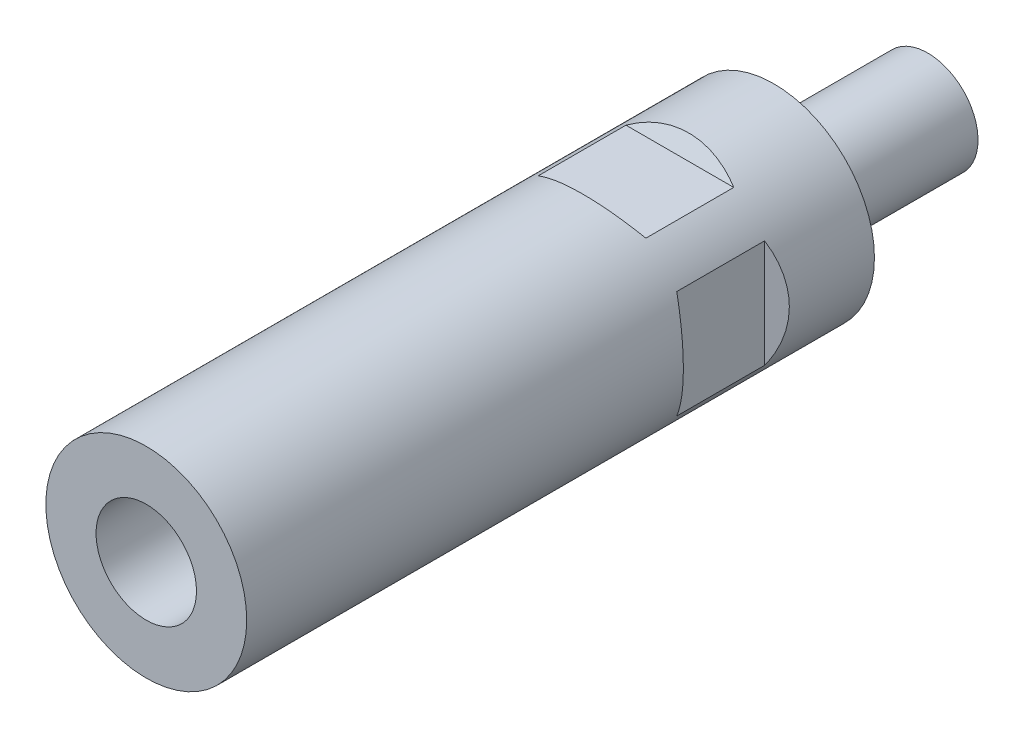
ISO-10303-21;
HEADER;
FILE_DESCRIPTION(('STEP AP214'),'2;1');
FILE_NAME('part.step','',(''),(''),'','','');
FILE_SCHEMA(('AUTOMOTIVE_DESIGN { 1 0 10303 214 1 1 1 1 }'));
ENDSEC;
DATA;
#1=APPLICATION_CONTEXT('core data for automotive mechanical design processes');
#2=APPLICATION_PROTOCOL_DEFINITION('international standard','automotive_design',2000,#1);
#3=PRODUCT_CONTEXT('',#1,'mechanical');
#4=PRODUCT('Part','Part','',(#3));
#5=PRODUCT_RELATED_PRODUCT_CATEGORY('part','',(#4));
#6=PRODUCT_DEFINITION_FORMATION('','',#4);
#7=PRODUCT_DEFINITION_CONTEXT('part definition',#1,'design');
#8=PRODUCT_DEFINITION('design','',#6,#7);
#9=PRODUCT_DEFINITION_SHAPE('','',#8);
#10=(LENGTH_UNIT() NAMED_UNIT(*) SI_UNIT(.MILLI.,.METRE.));
#11=(NAMED_UNIT(*) PLANE_ANGLE_UNIT() SI_UNIT($,.RADIAN.));
#12=(NAMED_UNIT(*) SI_UNIT($,.STERADIAN.) SOLID_ANGLE_UNIT());
#13=UNCERTAINTY_MEASURE_WITH_UNIT(LENGTH_MEASURE(1.E-05),#10,'distance_accuracy_value','');
#14=(GEOMETRIC_REPRESENTATION_CONTEXT(3) GLOBAL_UNCERTAINTY_ASSIGNED_CONTEXT((#13)) GLOBAL_UNIT_ASSIGNED_CONTEXT((#10,
#11,#12)) REPRESENTATION_CONTEXT('',''));
#15=CARTESIAN_POINT('',(0.,0.,0.));
#16=DIRECTION('',(0.,0.,1.));
#17=DIRECTION('',(1.,0.,0.));
#18=AXIS2_PLACEMENT_3D('',#15,#16,#17);
#19=CARTESIAN_POINT('',(0.,0.,-4.5));
#20=DIRECTION('',(0.,0.,1.));
#21=DIRECTION('',(0.,-1.,0.));
#22=AXIS2_PLACEMENT_3D('',#19,#20,#21);
#23=CYLINDRICAL_SURFACE('',#22,8.);
#24=CARTESIAN_POINT('',(0.,0.,-24.5));
#25=DIRECTION('',(0.,0.,1.));
#26=DIRECTION('',(0.,-1.,0.));
#27=AXIS2_PLACEMENT_3D('',#24,#25,#26);
#28=CIRCLE('',#27,8.);
#29=CARTESIAN_POINT('',(0.,-8.,-24.5));
#30=VERTEX_POINT('',#29);
#31=EDGE_CURVE('E22',#30,#30,#28,.F.);
#32=ORIENTED_EDGE('',*,*,#31,.F.);
#33=EDGE_LOOP('',(#32));
#34=FACE_BOUND('',#33,.T.);
#35=CARTESIAN_POINT('',(0.,0.,0.));
#36=DIRECTION('',(0.,0.,1.));
#37=DIRECTION('',(1.,0.,0.));
#38=AXIS2_PLACEMENT_3D('',#35,#36,#37);
#39=CIRCLE('',#38,8.);
#40=CARTESIAN_POINT('',(8.,0.,0.));
#41=VERTEX_POINT('',#40);
#42=EDGE_CURVE('E9',#41,#41,#39,.T.);
#43=ORIENTED_EDGE('',*,*,#42,.F.);
#44=EDGE_LOOP('',(#43));
#45=FACE_BOUND('',#44,.T.);
#46=ADVANCED_FACE('F14',(#34,#45),#23,.T.);
#47=CARTESIAN_POINT('',(0.,0.,-24.5));
#48=DIRECTION('',(0.,0.,1.));
#49=DIRECTION('',(0.,-1.,0.));
#50=AXIS2_PLACEMENT_3D('',#47,#48,#49);
#51=PLANE('',#50);
#52=ORIENTED_EDGE('',*,*,#31,.T.);
#53=EDGE_LOOP('',(#52));
#54=FACE_BOUND('',#53,.T.);
#55=ADVANCED_FACE('F16',(#54),#51,.F.);
#56=CARTESIAN_POINT('',(7.,0.,60.));
#57=DIRECTION('',(0.,0.,-1.));
#58=DIRECTION('',(-1.,0.,0.));
#59=AXIS2_PLACEMENT_3D('',#56,#57,#58);
#60=PLANE('',#59);
#61=CARTESIAN_POINT('',(0.,0.,60.));
#62=DIRECTION('',(0.,0.,1.));
#63=DIRECTION('',(1.,0.,0.));
#64=AXIS2_PLACEMENT_3D('',#61,#62,#63);
#65=CIRCLE('',#64,8.);
#66=CARTESIAN_POINT('',(8.,0.,60.));
#67=VERTEX_POINT('',#66);
#68=EDGE_CURVE('E251',#67,#67,#65,.T.);
#69=ORIENTED_EDGE('',*,*,#68,.T.);
#70=EDGE_LOOP('',(#69));
#71=FACE_BOUND('',#70,.T.);
#72=ADVANCED_FACE('F125',(#71),#60,.F.);
#73=CARTESIAN_POINT('',(0.,0.,100.));
#74=DIRECTION('',(0.,0.,1.));
#75=DIRECTION('',(1.,0.,0.));
#76=AXIS2_PLACEMENT_3D('',#73,#74,#75);
#77=CYLINDRICAL_SURFACE('',#76,8.);
#78=ORIENTED_EDGE('',*,*,#68,.F.);
#79=EDGE_LOOP('',(#78));
#80=FACE_BOUND('',#79,.T.);
#81=CARTESIAN_POINT('',(0.,0.,100.));
#82=DIRECTION('',(0.,0.,1.));
#83=DIRECTION('',(1.,0.,0.));
#84=AXIS2_PLACEMENT_3D('',#81,#82,#83);
#85=CIRCLE('',#84,8.);
#86=CARTESIAN_POINT('',(8.,0.,100.));
#87=VERTEX_POINT('',#86);
#88=EDGE_CURVE('E96',#87,#87,#85,.T.);
#89=ORIENTED_EDGE('',*,*,#88,.T.);
#90=EDGE_LOOP('',(#89));
#91=FACE_BOUND('',#90,.T.);
#92=ADVANCED_FACE('F127',(#80,#91),#77,.F.);
#93=CARTESIAN_POINT('',(0.,0.,100.));
#94=DIRECTION('',(0.,0.,1.));
#95=DIRECTION('',(1.,0.,0.));
#96=AXIS2_PLACEMENT_3D('',#93,#94,#95);
#97=PLANE('',#96);
#98=ORIENTED_EDGE('',*,*,#88,.F.);
#99=EDGE_LOOP('',(#98));
#100=FACE_BOUND('',#99,.T.);
#101=CARTESIAN_POINT('',(0.,0.,100.));
#102=DIRECTION('',(0.,0.,1.));
#103=DIRECTION('',(1.,0.,0.));
#104=AXIS2_PLACEMENT_3D('',#101,#102,#103);
#105=CIRCLE('',#104,16.);
#106=CARTESIAN_POINT('',(16.,0.,100.));
#107=VERTEX_POINT('',#106);
#108=EDGE_CURVE('E239',#107,#107,#105,.T.);
#109=ORIENTED_EDGE('',*,*,#108,.T.);
#110=EDGE_LOOP('',(#109));
#111=FACE_BOUND('',#110,.T.);
#112=ADVANCED_FACE('F134',(#100,#111),#97,.T.);
#113=CARTESIAN_POINT('',(13.5,-16.,29.));
#114=DIRECTION('',(-0.5,0.,0.86602540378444));
#115=DIRECTION('',(0.86602540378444,0.,0.5));
#116=AXIS2_PLACEMENT_3D('',#113,#114,#115);
#117=PLANE('',#116);
#118=DIRECTION('',(0.,1.,0.));
#119=VECTOR('',#118,1.);
#120=CARTESIAN_POINT('',(13.5,-16.,29.));
#121=LINE('',#120,#119);
#122=CARTESIAN_POINT('',(13.5,-8.58778201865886,29.));
#123=VERTEX_POINT('',#122);
#124=CARTESIAN_POINT('',(13.5,8.58778201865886,29.));
#125=VERTEX_POINT('',#124);
#126=EDGE_CURVE('E183',#123,#125,#121,.T.);
#127=ORIENTED_EDGE('',*,*,#126,.T.);
#128=CARTESIAN_POINT('',(0.,0.,21.2057713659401));
#129=DIRECTION('',(-0.5,0.,0.86602540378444));
#130=DIRECTION('',(-0.86602540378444,0.,-0.5));
#131=AXIS2_PLACEMENT_3D('',#128,#129,#130);
#132=ELLIPSE('',#131,18.475208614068,16.);
#133=EDGE_CURVE('E35',#123,#125,#132,.T.);
#134=ORIENTED_EDGE('',*,*,#133,.F.);
#135=EDGE_LOOP('',(#127,#134));
#136=FACE_BOUND('',#135,.T.);
#137=ADVANCED_FACE('F175',(#136),#117,.F.);
#138=CARTESIAN_POINT('',(13.5,-16.,29.));
#139=DIRECTION('',(-1.,0.,0.));
#140=DIRECTION('',(0.,0.,1.));
#141=AXIS2_PLACEMENT_3D('',#138,#139,#140);
#142=PLANE('',#141);
#143=ORIENTED_EDGE('',*,*,#126,.F.);
#144=DIRECTION('',(0.,0.,-1.));
#145=VECTOR('',#144,1.);
#146=CARTESIAN_POINT('',(13.5,-8.58778201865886,100.));
#147=LINE('',#146,#145);
#148=CARTESIAN_POINT('',(13.5,-8.58778201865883,15.));
#149=VERTEX_POINT('',#148);
#150=EDGE_CURVE('E191',#149,#123,#147,.F.);
#151=ORIENTED_EDGE('',*,*,#150,.F.);
#152=DIRECTION('',(0.,1.,0.));
#153=VECTOR('',#152,1.);
#154=CARTESIAN_POINT('',(13.5,-16.,15.));
#155=LINE('',#154,#153);
#156=CARTESIAN_POINT('',(13.5,8.58778201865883,15.));
#157=VERTEX_POINT('',#156);
#158=EDGE_CURVE('E187',#149,#157,#155,.T.);
#159=ORIENTED_EDGE('',*,*,#158,.T.);
#160=DIRECTION('',(0.,0.,-1.));
#161=VECTOR('',#160,1.);
#162=CARTESIAN_POINT('',(13.5,8.58778201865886,100.));
#163=LINE('',#162,#161);
#164=EDGE_CURVE('E29',#125,#157,#163,.T.);
#165=ORIENTED_EDGE('',*,*,#164,.F.);
#166=EDGE_LOOP('',(#143,#151,#159,#165));
#167=FACE_BOUND('',#166,.T.);
#168=ADVANCED_FACE('F172',(#167),#142,.F.);
#169=CARTESIAN_POINT('',(13.5,-16.,15.));
#170=DIRECTION('',(-0.5,0.,-0.866025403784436));
#171=DIRECTION('',(-0.866025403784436,0.,0.5));
#172=AXIS2_PLACEMENT_3D('',#169,#170,#171);
#173=PLANE('',#172);
#174=CARTESIAN_POINT('',(0.,0.,22.7942286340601));
#175=DIRECTION('',(-0.5,0.,-0.866025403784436));
#176=DIRECTION('',(0.866025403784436,0.,-0.5));
#177=AXIS2_PLACEMENT_3D('',#174,#175,#176);
#178=ELLIPSE('',#177,18.4752086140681,16.);
#179=EDGE_CURVE('E195',#157,#149,#178,.T.);
#180=ORIENTED_EDGE('',*,*,#179,.F.);
#181=ORIENTED_EDGE('',*,*,#158,.F.);
#182=EDGE_LOOP('',(#180,#181));
#183=FACE_BOUND('',#182,.T.);
#184=ADVANCED_FACE('F167',(#183),#173,.F.);
#185=CARTESIAN_POINT('',(-13.5,-16.,15.));
#186=DIRECTION('',(0.5,0.,-0.866025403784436));
#187=DIRECTION('',(-0.866025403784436,0.,-0.5));
#188=AXIS2_PLACEMENT_3D('',#185,#186,#187);
#189=PLANE('',#188);
#190=CARTESIAN_POINT('',(0.,0.,22.7942286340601));
#191=DIRECTION('',(0.5,0.,-0.866025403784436));
#192=DIRECTION('',(-0.866025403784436,0.,-0.5));
#193=AXIS2_PLACEMENT_3D('',#190,#191,#192);
#194=ELLIPSE('',#193,18.4752086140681,16.);
#195=CARTESIAN_POINT('',(-13.5,-8.58778201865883,15.));
#196=VERTEX_POINT('',#195);
#197=CARTESIAN_POINT('',(-13.5,8.58778201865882,15.));
#198=VERTEX_POINT('',#197);
#199=EDGE_CURVE('E193',#196,#198,#194,.T.);
#200=ORIENTED_EDGE('',*,*,#199,.F.);
#201=DIRECTION('',(0.,1.,0.));
#202=VECTOR('',#201,1.);
#203=CARTESIAN_POINT('',(-13.5,-16.,15.));
#204=LINE('',#203,#202);
#205=EDGE_CURVE('E227',#196,#198,#204,.T.);
#206=ORIENTED_EDGE('',*,*,#205,.T.);
#207=EDGE_LOOP('',(#200,#206));
#208=FACE_BOUND('',#207,.T.);
#209=ADVANCED_FACE('F163',(#208),#189,.F.);
#210=CARTESIAN_POINT('',(-13.5,-16.,29.));
#211=DIRECTION('',(0.5,0.,0.86602540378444));
#212=DIRECTION('',(0.86602540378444,0.,-0.5));
#213=AXIS2_PLACEMENT_3D('',#210,#211,#212);
#214=PLANE('',#213);
#215=DIRECTION('',(0.,1.,0.));
#216=VECTOR('',#215,1.);
#217=CARTESIAN_POINT('',(-13.5,-16.,29.));
#218=LINE('',#217,#216);
#219=CARTESIAN_POINT('',(-13.5,-8.58778201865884,29.));
#220=VERTEX_POINT('',#219);
#221=CARTESIAN_POINT('',(-13.5,8.58778201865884,29.));
#222=VERTEX_POINT('',#221);
#223=EDGE_CURVE('E231',#220,#222,#218,.T.);
#224=ORIENTED_EDGE('',*,*,#223,.F.);
#225=CARTESIAN_POINT('',(0.,0.,21.2057713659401));
#226=DIRECTION('',(0.5,0.,0.86602540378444));
#227=DIRECTION('',(0.86602540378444,0.,-0.5));
#228=AXIS2_PLACEMENT_3D('',#225,#226,#227);
#229=ELLIPSE('',#228,18.475208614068,16.);
#230=EDGE_CURVE('E206',#222,#220,#229,.T.);
#231=ORIENTED_EDGE('',*,*,#230,.F.);
#232=EDGE_LOOP('',(#224,#231));
#233=FACE_BOUND('',#232,.T.);
#234=ADVANCED_FACE('F160',(#233),#214,.F.);
#235=CARTESIAN_POINT('',(-13.5,-16.,29.));
#236=DIRECTION('',(1.,0.,0.));
#237=DIRECTION('',(0.,0.,-1.));
#238=AXIS2_PLACEMENT_3D('',#235,#236,#237);
#239=PLANE('',#238);
#240=ORIENTED_EDGE('',*,*,#223,.T.);
#241=DIRECTION('',(0.,0.,-1.));
#242=VECTOR('',#241,1.);
#243=CARTESIAN_POINT('',(-13.5,8.5877820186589,100.));
#244=LINE('',#243,#242);
#245=EDGE_CURVE('E200',#198,#222,#244,.F.);
#246=ORIENTED_EDGE('',*,*,#245,.F.);
#247=ORIENTED_EDGE('',*,*,#205,.F.);
#248=DIRECTION('',(0.,0.,-1.));
#249=VECTOR('',#248,1.);
#250=CARTESIAN_POINT('',(-13.5,-8.5877820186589,100.));
#251=LINE('',#250,#249);
#252=EDGE_CURVE('E203',#220,#196,#251,.T.);
#253=ORIENTED_EDGE('',*,*,#252,.F.);
#254=EDGE_LOOP('',(#240,#246,#247,#253));
#255=FACE_BOUND('',#254,.T.);
#256=ADVANCED_FACE('F158',(#255),#239,.F.);
#257=CARTESIAN_POINT('',(16.,13.5,29.));
#258=DIRECTION('',(0.,-0.5,0.86602540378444));
#259=DIRECTION('',(0.,-0.86602540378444,-0.5));
#260=AXIS2_PLACEMENT_3D('',#257,#258,#259);
#261=PLANE('',#260);
#262=DIRECTION('',(-1.,0.,0.));
#263=VECTOR('',#262,1.);
#264=CARTESIAN_POINT('',(16.,13.5,29.));
#265=LINE('',#264,#263);
#266=CARTESIAN_POINT('',(8.58778201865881,13.5,29.));
#267=VERTEX_POINT('',#266);
#268=CARTESIAN_POINT('',(-8.58778201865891,13.5,29.));
#269=VERTEX_POINT('',#268);
#270=EDGE_CURVE('E225',#267,#269,#265,.T.);
#271=ORIENTED_EDGE('',*,*,#270,.T.);
#272=CARTESIAN_POINT('',(0.,0.,21.2057713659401));
#273=DIRECTION('',(0.,-0.5,0.86602540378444));
#274=DIRECTION('',(0.,-0.86602540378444,-0.5));
#275=AXIS2_PLACEMENT_3D('',#272,#273,#274);
#276=ELLIPSE('',#275,18.475208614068,16.);
#277=EDGE_CURVE('E214',#267,#269,#276,.T.);
#278=ORIENTED_EDGE('',*,*,#277,.F.);
#279=EDGE_LOOP('',(#271,#278));
#280=FACE_BOUND('',#279,.T.);
#281=ADVANCED_FACE('F151',(#280),#261,.F.);
#282=CARTESIAN_POINT('',(16.,13.5,29.));
#283=DIRECTION('',(0.,-1.,0.));
#284=DIRECTION('',(1.,0.,0.));
#285=AXIS2_PLACEMENT_3D('',#282,#283,#284);
#286=PLANE('',#285);
#287=ORIENTED_EDGE('',*,*,#270,.F.);
#288=DIRECTION('',(0.,0.,-1.));
#289=VECTOR('',#288,1.);
#290=CARTESIAN_POINT('',(8.58778201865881,13.5,100.));
#291=LINE('',#290,#289);
#292=CARTESIAN_POINT('',(8.58778201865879,13.5,15.));
#293=VERTEX_POINT('',#292);
#294=EDGE_CURVE('E88',#293,#267,#291,.F.);
#295=ORIENTED_EDGE('',*,*,#294,.F.);
#296=DIRECTION('',(-1.,0.,0.));
#297=VECTOR('',#296,1.);
#298=CARTESIAN_POINT('',(16.,13.5,15.));
#299=LINE('',#298,#297);
#300=CARTESIAN_POINT('',(-8.58778201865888,13.5,15.));
#301=VERTEX_POINT('',#300);
#302=EDGE_CURVE('E223',#293,#301,#299,.T.);
#303=ORIENTED_EDGE('',*,*,#302,.T.);
#304=DIRECTION('',(0.,0.,-1.));
#305=VECTOR('',#304,1.);
#306=CARTESIAN_POINT('',(-8.58778201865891,13.5,100.));
#307=LINE('',#306,#305);
#308=EDGE_CURVE('E211',#269,#301,#307,.T.);
#309=ORIENTED_EDGE('',*,*,#308,.F.);
#310=EDGE_LOOP('',(#287,#295,#303,#309));
#311=FACE_BOUND('',#310,.T.);
#312=ADVANCED_FACE('F148',(#311),#286,.F.);
#313=CARTESIAN_POINT('',(16.,13.5,15.));
#314=DIRECTION('',(0.,-0.5,-0.866025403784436));
#315=DIRECTION('',(0.,0.866025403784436,-0.5));
#316=AXIS2_PLACEMENT_3D('',#313,#314,#315);
#317=PLANE('',#316);
#318=CARTESIAN_POINT('',(0.,0.,22.7942286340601));
#319=DIRECTION('',(0.,-0.5,-0.866025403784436));
#320=DIRECTION('',(0.,0.866025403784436,-0.5));
#321=AXIS2_PLACEMENT_3D('',#318,#319,#320);
#322=ELLIPSE('',#321,18.4752086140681,16.);
#323=EDGE_CURVE('E209',#301,#293,#322,.T.);
#324=ORIENTED_EDGE('',*,*,#323,.F.);
#325=ORIENTED_EDGE('',*,*,#302,.F.);
#326=EDGE_LOOP('',(#324,#325));
#327=FACE_BOUND('',#326,.T.);
#328=ADVANCED_FACE('F145',(#327),#317,.F.);
#329=CARTESIAN_POINT('',(16.,-13.5,15.));
#330=DIRECTION('',(0.,0.5,-0.866025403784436));
#331=DIRECTION('',(0.,0.866025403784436,0.5));
#332=AXIS2_PLACEMENT_3D('',#329,#330,#331);
#333=PLANE('',#332);
#334=CARTESIAN_POINT('',(0.,0.,22.7942286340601));
#335=DIRECTION('',(0.,0.5,-0.866025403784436));
#336=DIRECTION('',(0.,-0.866025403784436,-0.5));
#337=AXIS2_PLACEMENT_3D('',#334,#335,#336);
#338=ELLIPSE('',#337,18.4752086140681,16.);
#339=CARTESIAN_POINT('',(8.58778201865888,-13.5,15.));
#340=VERTEX_POINT('',#339);
#341=CARTESIAN_POINT('',(-8.58778201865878,-13.5,15.));
#342=VERTEX_POINT('',#341);
#343=EDGE_CURVE('E79',#340,#342,#338,.T.);
#344=ORIENTED_EDGE('',*,*,#343,.F.);
#345=DIRECTION('',(-1.,0.,0.));
#346=VECTOR('',#345,1.);
#347=CARTESIAN_POINT('',(16.,-13.5,15.));
#348=LINE('',#347,#346);
#349=EDGE_CURVE('E82',#340,#342,#348,.T.);
#350=ORIENTED_EDGE('',*,*,#349,.T.);
#351=EDGE_LOOP('',(#344,#350));
#352=FACE_BOUND('',#351,.T.);
#353=ADVANCED_FACE('F81',(#352),#333,.F.);
#354=CARTESIAN_POINT('',(16.,-13.5,29.));
#355=DIRECTION('',(0.,0.5,0.86602540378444));
#356=DIRECTION('',(0.,-0.86602540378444,0.5));
#357=AXIS2_PLACEMENT_3D('',#354,#355,#356);
#358=PLANE('',#357);
#359=DIRECTION('',(-1.,0.,0.));
#360=VECTOR('',#359,1.);
#361=CARTESIAN_POINT('',(16.,-13.5,29.));
#362=LINE('',#361,#360);
#363=CARTESIAN_POINT('',(8.58778201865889,-13.5,29.));
#364=VERTEX_POINT('',#363);
#365=CARTESIAN_POINT('',(-8.58778201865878,-13.5,29.));
#366=VERTEX_POINT('',#365);
#367=EDGE_CURVE('E95',#364,#366,#362,.T.);
#368=ORIENTED_EDGE('',*,*,#367,.F.);
#369=CARTESIAN_POINT('',(0.,0.,21.2057713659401));
#370=DIRECTION('',(0.,0.5,0.86602540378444));
#371=DIRECTION('',(0.,0.86602540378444,-0.5));
#372=AXIS2_PLACEMENT_3D('',#369,#370,#371);
#373=ELLIPSE('',#372,18.475208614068,16.);
#374=EDGE_CURVE('E101',#366,#364,#373,.T.);
#375=ORIENTED_EDGE('',*,*,#374,.F.);
#376=EDGE_LOOP('',(#368,#375));
#377=FACE_BOUND('',#376,.T.);
#378=ADVANCED_FACE('F139',(#377),#358,.F.);
#379=CARTESIAN_POINT('',(16.,-13.5,29.));
#380=DIRECTION('',(0.,1.,0.));
#381=DIRECTION('',(-1.,0.,0.));
#382=AXIS2_PLACEMENT_3D('',#379,#380,#381);
#383=PLANE('',#382);
#384=ORIENTED_EDGE('',*,*,#367,.T.);
#385=DIRECTION('',(0.,0.,-1.));
#386=VECTOR('',#385,1.);
#387=CARTESIAN_POINT('',(-8.58778201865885,-13.5,100.));
#388=LINE('',#387,#386);
#389=EDGE_CURVE('E87',#342,#366,#388,.F.);
#390=ORIENTED_EDGE('',*,*,#389,.F.);
#391=ORIENTED_EDGE('',*,*,#349,.F.);
#392=DIRECTION('',(0.,0.,-1.));
#393=VECTOR('',#392,1.);
#394=CARTESIAN_POINT('',(8.58778201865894,-13.5,100.));
#395=LINE('',#394,#393);
#396=EDGE_CURVE('E93',#364,#340,#395,.T.);
#397=ORIENTED_EDGE('',*,*,#396,.F.);
#398=EDGE_LOOP('',(#384,#390,#391,#397));
#399=FACE_BOUND('',#398,.T.);
#400=ADVANCED_FACE('F92',(#399),#383,.F.);
#401=CARTESIAN_POINT('',(0.,0.,100.));
#402=DIRECTION('',(0.,0.,-1.));
#403=DIRECTION('',(-1.,0.,0.));
#404=AXIS2_PLACEMENT_3D('',#401,#402,#403);
#405=CYLINDRICAL_SURFACE('',#404,16.);
#406=ORIENTED_EDGE('',*,*,#389,.T.);
#407=ORIENTED_EDGE('',*,*,#374,.T.);
#408=ORIENTED_EDGE('',*,*,#396,.T.);
#409=ORIENTED_EDGE('',*,*,#343,.T.);
#410=EDGE_LOOP('',(#406,#407,#408,#409));
#411=FACE_BOUND('',#410,.T.);
#412=ORIENTED_EDGE('',*,*,#323,.T.);
#413=ORIENTED_EDGE('',*,*,#294,.T.);
#414=ORIENTED_EDGE('',*,*,#277,.T.);
#415=ORIENTED_EDGE('',*,*,#308,.T.);
#416=EDGE_LOOP('',(#412,#413,#414,#415));
#417=FACE_BOUND('',#416,.T.);
#418=ORIENTED_EDGE('',*,*,#245,.T.);
#419=ORIENTED_EDGE('',*,*,#230,.T.);
#420=ORIENTED_EDGE('',*,*,#252,.T.);
#421=ORIENTED_EDGE('',*,*,#199,.T.);
#422=EDGE_LOOP('',(#418,#419,#420,#421));
#423=FACE_BOUND('',#422,.T.);
#424=ORIENTED_EDGE('',*,*,#179,.T.);
#425=ORIENTED_EDGE('',*,*,#150,.T.);
#426=ORIENTED_EDGE('',*,*,#133,.T.);
#427=ORIENTED_EDGE('',*,*,#164,.T.);
#428=EDGE_LOOP('',(#424,#425,#426,#427));
#429=FACE_BOUND('',#428,.T.);
#430=ORIENTED_EDGE('',*,*,#108,.F.);
#431=EDGE_LOOP('',(#430));
#432=FACE_BOUND('',#431,.T.);
#433=CARTESIAN_POINT('',(0.,0.,0.));
#434=DIRECTION('',(0.,0.,1.));
#435=DIRECTION('',(1.,0.,0.));
#436=AXIS2_PLACEMENT_3D('',#433,#434,#435);
#437=CIRCLE('',#436,16.);
#438=CARTESIAN_POINT('',(16.,0.,0.));
#439=VERTEX_POINT('',#438);
#440=EDGE_CURVE('E186',#439,#439,#437,.T.);
#441=ORIENTED_EDGE('',*,*,#440,.T.);
#442=EDGE_LOOP('',(#441));
#443=FACE_BOUND('',#442,.T.);
#444=ADVANCED_FACE('F99',(#411,#417,#423,#429,#432,#443),#405,.T.);
#445=CARTESIAN_POINT('',(0.,0.,0.));
#446=DIRECTION('',(0.,0.,1.));
#447=DIRECTION('',(1.,0.,0.));
#448=AXIS2_PLACEMENT_3D('',#445,#446,#447);
#449=PLANE('',#448);
#450=ORIENTED_EDGE('',*,*,#440,.F.);
#451=EDGE_LOOP('',(#450));
#452=FACE_BOUND('',#451,.T.);
#453=ORIENTED_EDGE('',*,*,#42,.T.);
#454=EDGE_LOOP('',(#453));
#455=FACE_BOUND('',#454,.T.);
#456=ADVANCED_FACE('F111',(#452,#455),#449,.F.);
#457=CLOSED_SHELL('',(#46,#55,#72,#92,#112,#137,#168,#184,#209,#234,#256,#281,#312,#328,#353,
#378,#400,#444,#456));
#458=MANIFOLD_SOLID_BREP('B1',#457);
#459=ADVANCED_BREP_SHAPE_REPRESENTATION('',(#18,#458),#14);
#460=SHAPE_DEFINITION_REPRESENTATION(#9,#459);
ENDSEC;
END-ISO-10303-21;
